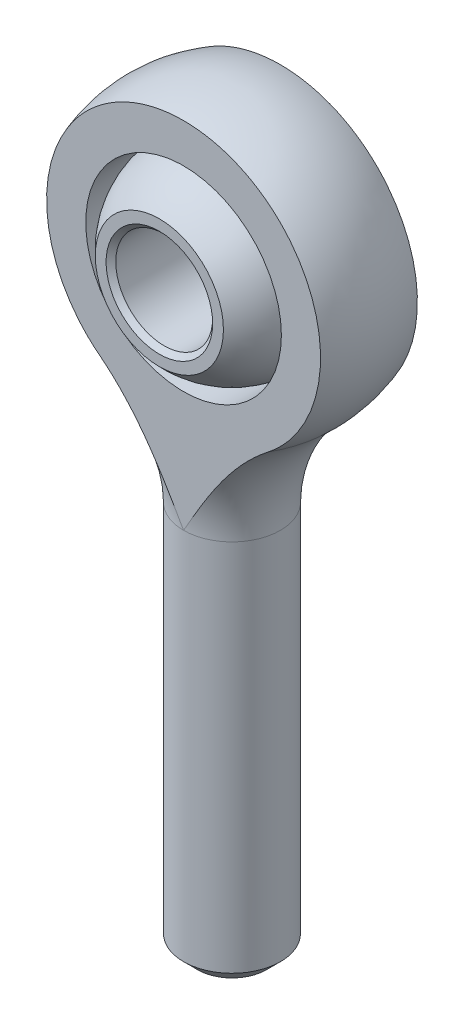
from build123d import *

# Parameters (mm, degrees)
SKETCH1_W               = 3.175
SKETCH1_H               = 25.4
CHAMFER2_SIZE           = 0.90678
CUT_EXTRUDE1_DEPTH      = 29.750847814
CUT_EXTRUDE1_DEPTH_BACK = 29.750847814
CUT_EXTRUDE2_DEPTH      = 28.312382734
CUT_EXTRUDE2_DEPTH_BACK = 28.312382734
SKETCH6_R               = 6.4135
CUT_EXTRUDE3_DEPTH      = 28.86051193
CUT_EXTRUDE3_DEPTH_BACK = 28.86051193
SKETCH8_W               = 4.7625
SKETCH8_H               = 23.8125
CUT_EXTRUDE4_DEPTH      = 28.86051193
CUT_EXTRUDE4_DEPTH_BACK = 28.86051193
SKETCH10_R              = 3.175
CHAMFER1_SIZE           = 0.3175


with BuildPart() as part:
    # Sketch1 → Revolve1 (revolve)
    with BuildSketch(Plane.XY, mode=Mode.PRIVATE) as revolve1_sk:
        with Locations((1.5875, -12.7)):
            Rectangle(SKETCH1_W, SKETCH1_H)
    revolve(revolve1_sk.sketch.rotate(Axis((0, 23.8125, 0), (0, -1, 0)), 180), axis=Axis((0, 23.8125, 0), (0, -1, 0)))

    # Chamfer2
    chamfer2_edges = [part.edges().sort_by_distance(p)[0] for p in [
        (3.175, -25.4, 0),
    ]]
    chamfer(chamfer2_edges, length=CHAMFER2_SIZE)

    # Sketch4 → Revolve2 (revolve)
    with BuildSketch(Plane.XY):
        with BuildLine():
            Line((3.175, 0), (0, 0))
            Line((0, 0), (0, 23.8125))
            ThreePointArc((0, 23.8125), (8.890116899, 17.70677573), (6.382731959, 7.217396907))
            ThreePointArc((6.382731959, 7.217396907), (4.01304802, 3.949061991), (3.175, 0))
        make_face()
    revolve(axis=Axis((0, 23.8125, 0), (0, 1, 0)))

    # Sketch5 → Cut-Extrude1 (cut, two sides: drawn at the far end of the back side and taken through both)
    with BuildSketch(Plane(origin=(0, 0, 0), x_dir=(0, 0, -1), z_dir=(1, 0, 0)).offset(-CUT_EXTRUDE1_DEPTH_BACK)):
        Polygon((3.175, 23.8125), (9.525, 23.8125), (9.525, 0), (3.175, 0), (3.175, 1.27), align=None)
        Polygon((-3.175, 23.8125), (-3.175, 1.27), (-3.175, 0), (-9.525, 0), (-9.525, 23.8125), align=None)
    extrude(amount=CUT_EXTRUDE1_DEPTH + CUT_EXTRUDE1_DEPTH_BACK, mode=Mode.SUBTRACT)

    # Sketch6 → Cut-Extrude2 (cut, two sides: drawn at the far end of the back side and taken through both)
    with BuildSketch(Plane.XY.offset(-CUT_EXTRUDE2_DEPTH_BACK)):
        with Locations((0, 14.2875)):
            Circle(SKETCH6_R)
    extrude(amount=CUT_EXTRUDE2_DEPTH + CUT_EXTRUDE2_DEPTH_BACK, mode=Mode.SUBTRACT)


with BuildPart() as body_2:
    # Sketch7 → Revolve3 (revolve)
    with BuildSketch(Plane.XY):
        with BuildLine():
            Line((0, 20.6375), (0, 7.9375))
            ThreePointArc((0, 7.9375), (6.35, 14.2875), (0, 20.6375))
        make_face()
    revolve(axis=Axis((0, 0, 0), (0, 1, 0)))

    # Sketch8 → Cut-Extrude3 (cut, two sides: drawn at the far end of the back side and taken through both)
    with BuildSketch(Plane(origin=(0, 0, 0), x_dir=(0, 0, -1), z_dir=(1, 0, 0)).offset(-CUT_EXTRUDE3_DEPTH_BACK)):
        with Locations((-7.14375, 11.90625)):
            Rectangle(SKETCH8_W, SKETCH8_H)
        with Locations((7.14375, 11.90625)):
            Rectangle(SKETCH8_W, SKETCH8_H)
    extrude(amount=CUT_EXTRUDE3_DEPTH + CUT_EXTRUDE3_DEPTH_BACK, mode=Mode.SUBTRACT)

    # Sketch10 → Cut-Extrude4 (cut, two sides: drawn at the far end of the back side and taken through both)
    with BuildSketch(Plane.XY.offset(-CUT_EXTRUDE4_DEPTH_BACK)):
        with Locations((0, 14.2875)):
            Circle(SKETCH10_R)
    extrude(amount=CUT_EXTRUDE4_DEPTH + CUT_EXTRUDE4_DEPTH_BACK, mode=Mode.SUBTRACT)

    # Chamfer1
    chamfer1_edges = [body_2.edges().sort_by_distance(p)[0] for p in [
        (-3.175, 14.2875, -4.7625),
        (-3.175, 14.2875, 4.7625),
    ]]
    chamfer(chamfer1_edges, length=CHAMFER1_SIZE)


solid = Compound([part.part, body_2.part])
